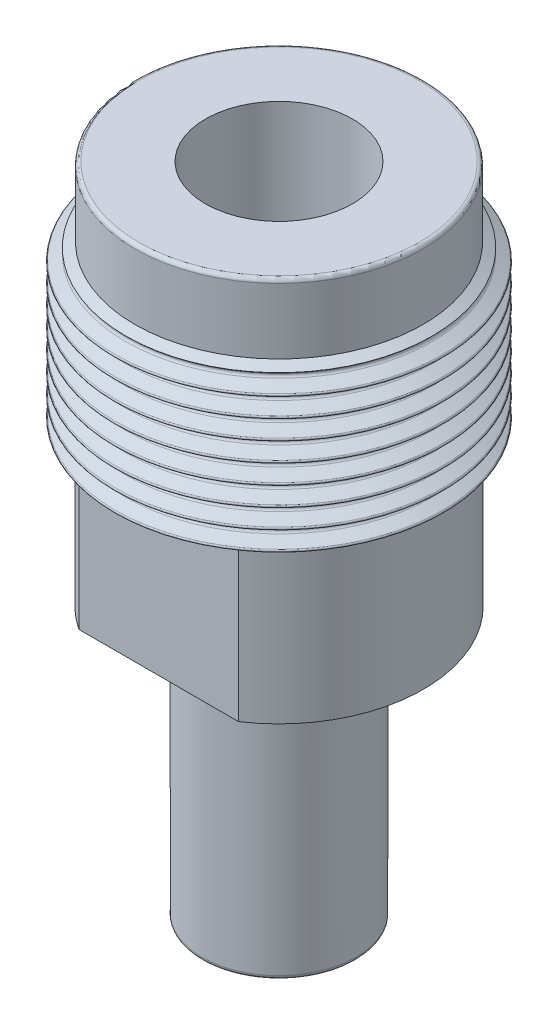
from build123d import *

# Parameters (mm, degrees)
LPATTERN1_COUNT         = 13
LPATTERN1_PITCH         = 0.635
CUT_EXTRUDE2_DEPTH      = 2.54
CUT_EXTRUDE2_DEPTH_BACK = 5.08
FILLET1_R               = 0.127


with BuildPart() as part:
    # Sketch1 → Revolve1 (revolve)
    with BuildSketch(Plane.XY, mode=Mode.PRIVATE) as revolve1_sk:
        with BuildLine():
            Line((-2.4257, -3.81), (-1.905, -4.122868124))
            Line((-1.905, -4.122868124), (-1.905, -21.59))
            Line((-1.905, -21.59), (-2.54, -21.59))
            Line((-2.54, -21.59), (-2.54, -13.4874))
            ThreePointArc((-2.54, -13.4874), (-2.77062412, -12.93062412), (-3.3274, -12.7))
            Line((-3.3274, -12.7), (-4.7625, -12.7))
            Line((-4.7625, -12.7), (-4.7625, -7.62))
            Line((-4.7625, -7.62), (-5.4229, -7.62))
            Line((-5.4229, -7.62), (-5.4229, 0))
            Line((-5.4229, 0), (-2.4257, 0))
            Line((-2.4257, 0), (-2.4257, -3.81))
        make_face()
    revolve(revolve1_sk.sketch.rotate(Axis((0, 0, 0), (0, -1, 0)), 270), axis=Axis((0, 0, 0), (0, -1, 0)))

    # Sketch2 → Cut-Revolve1 (revolve, cut)
    with BuildSketch(Plane.XY, mode=Mode.PRIVATE) as cut_revolve1_sk:
        with BuildLine():
            Line((-5.4229, 0.3175), (-5.4229, -0.3175))
            ThreePointArc((-5.4229, -0.3175), (-5.416760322, -0.294586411), (-5.399986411, -0.2778125))
            Line((-5.399986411, -0.2778125), (-5.056282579, -0.079375))
            ThreePointArc((-5.056282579, -0.079375), (-5.010455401, 0), (-5.056282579, 0.079375))
            Line((-5.056282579, 0.079375), (-5.399986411, 0.2778125))
            ThreePointArc((-5.399986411, 0.2778125), (-5.416760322, 0.294586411), (-5.4229, 0.3175))
        make_face()
    cut_revolve1 = revolve(cut_revolve1_sk.sketch.rotate(Axis((0, -7.62, 0), (0, 1, 0)), 270), axis=Axis((0, -7.62, 0), (0, 1, 0)), mode=Mode.SUBTRACT)

    # LPattern1: Cut-Revolve1 ×13
    with Locations(*[(0, -i * LPATTERN1_PITCH, 0) for i in range(1, LPATTERN1_COUNT)]):
        add(cut_revolve1, mode=Mode.SUBTRACT)

    # Sketch4 → Cut-Extrude2 (cut, two sides: drawn at the far end of the back side and taken through both)
    with BuildSketch(Plane.XZ.offset(12.7).offset(-CUT_EXTRUDE2_DEPTH_BACK)):
        with BuildLine():
            Line((-2.632570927, 3.96875), (2.632570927, 3.96875))
            ThreePointArc((2.632570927, 3.96875), (0, 4.7625), (-2.632570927, 3.96875))
        make_face()
        with BuildLine():
            Line((-2.632570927, -3.96875), (2.632570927, -3.96875))
            ThreePointArc((2.632570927, -3.96875), (0, -4.7625), (-2.632570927, -3.96875))
        make_face()
    extrude(amount=CUT_EXTRUDE2_DEPTH + CUT_EXTRUDE2_DEPTH_BACK, mode=Mode.SUBTRACT)

    # Sketch5 → Cut-Revolve2 (revolve, cut)
    with BuildSketch(Plane.XY, mode=Mode.PRIVATE) as cut_revolve2_sk:
        Polygon((-4.7498, 0), (-6.406269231, 0), (-6.406269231, -3.242362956), (-4.7498, -2.286), align=None)
    revolve(cut_revolve2_sk.sketch.rotate(Axis((0, 0, 0), (0, 1, 0)), 270), axis=Axis((0, 0, 0), (0, 1, 0)), mode=Mode.SUBTRACT)

    # Fillet1
    fillet1_edges = [part.edges().sort_by_distance(p)[0] for p in [
        (0, 0, 4.7498),
        (0, -21.59, -1.905),
        (0, -21.59, -2.54),
    ]]
    fillet(fillet1_edges, radius=FILLET1_R)


solid = part.part
